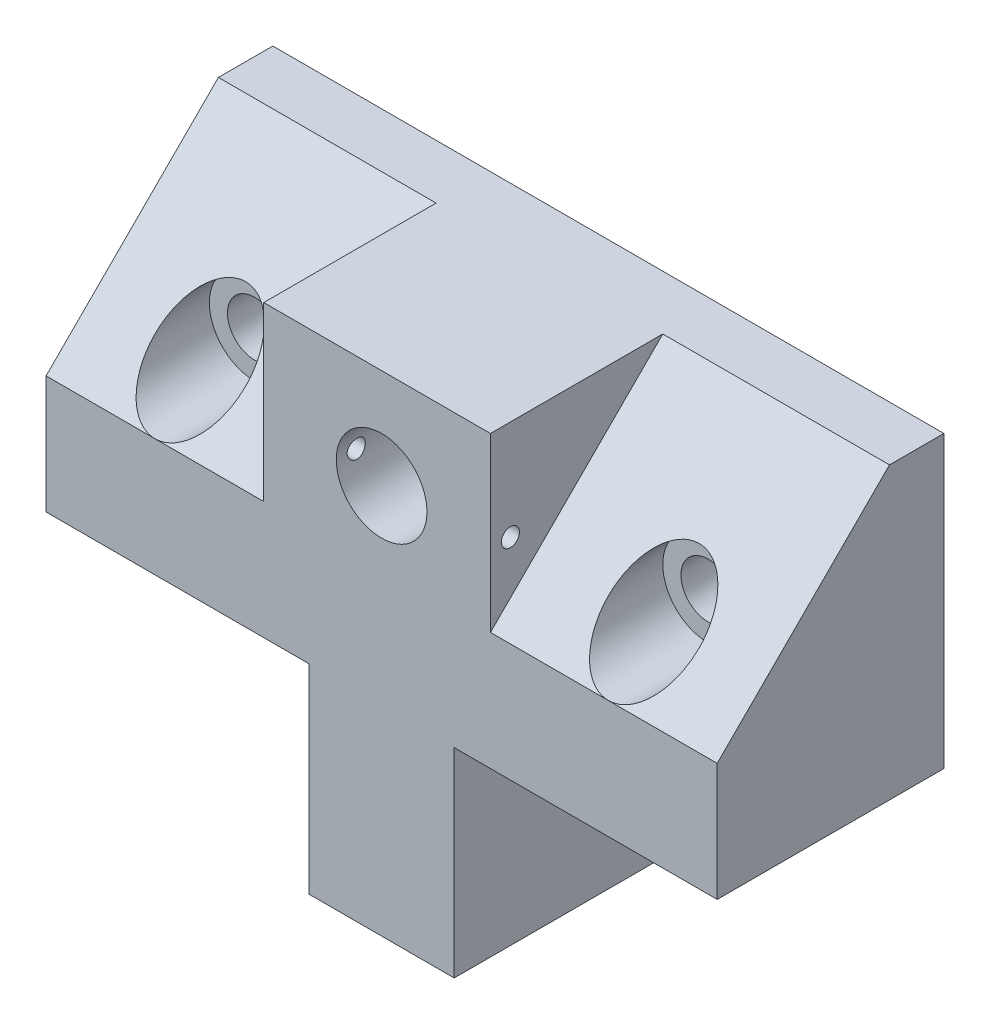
ISO-10303-21;
HEADER;
FILE_DESCRIPTION(('STEP AP214'),'2;1');
FILE_NAME('part.step','',(''),(''),'','','');
FILE_SCHEMA(('AUTOMOTIVE_DESIGN { 1 0 10303 214 1 1 1 1 }'));
ENDSEC;
DATA;
#1=APPLICATION_CONTEXT('core data for automotive mechanical design processes');
#2=APPLICATION_PROTOCOL_DEFINITION('international standard','automotive_design',2000,#1);
#3=PRODUCT_CONTEXT('',#1,'mechanical');
#4=PRODUCT('Part','Part','',(#3));
#5=PRODUCT_RELATED_PRODUCT_CATEGORY('part','',(#4));
#6=PRODUCT_DEFINITION_FORMATION('','',#4);
#7=PRODUCT_DEFINITION_CONTEXT('part definition',#1,'design');
#8=PRODUCT_DEFINITION('design','',#6,#7);
#9=PRODUCT_DEFINITION_SHAPE('','',#8);
#10=(LENGTH_UNIT() NAMED_UNIT(*) SI_UNIT(.MILLI.,.METRE.));
#11=(NAMED_UNIT(*) PLANE_ANGLE_UNIT() SI_UNIT($,.RADIAN.));
#12=(NAMED_UNIT(*) SI_UNIT($,.STERADIAN.) SOLID_ANGLE_UNIT());
#13=UNCERTAINTY_MEASURE_WITH_UNIT(LENGTH_MEASURE(1.E-05),#10,'distance_accuracy_value','');
#14=(GEOMETRIC_REPRESENTATION_CONTEXT(3) GLOBAL_UNCERTAINTY_ASSIGNED_CONTEXT((#13)) GLOBAL_UNIT_ASSIGNED_CONTEXT((#10,
#11,#12)) REPRESENTATION_CONTEXT('',''));
#15=CARTESIAN_POINT('',(0.,0.,0.));
#16=DIRECTION('',(0.,0.,1.));
#17=DIRECTION('',(1.,0.,0.));
#18=AXIS2_PLACEMENT_3D('',#15,#16,#17);
#19=CARTESIAN_POINT('',(-37.,54.,-12.5));
#20=DIRECTION('',(0.,0.,1.));
#21=DIRECTION('',(1.,0.,0.));
#22=AXIS2_PLACEMENT_3D('',#19,#20,#21);
#23=PLANE('',#22);
#24=DIRECTION('',(0.,-1.,0.));
#25=VECTOR('',#24,1.);
#26=CARTESIAN_POINT('',(-8.,22.,-12.5));
#27=LINE('',#26,#25);
#28=CARTESIAN_POINT('',(-8.,22.,-12.5));
#29=VERTEX_POINT('',#28);
#30=CARTESIAN_POINT('',(-8.,0.,-12.5));
#31=VERTEX_POINT('',#30);
#32=EDGE_CURVE('E152',#29,#31,#27,.T.);
#33=ORIENTED_EDGE('',*,*,#32,.F.);
#34=DIRECTION('',(1.,0.,0.));
#35=VECTOR('',#34,1.);
#36=CARTESIAN_POINT('',(-37.,22.,-12.5));
#37=LINE('',#36,#35);
#38=CARTESIAN_POINT('',(-37.,22.,-12.5));
#39=VERTEX_POINT('',#38);
#40=EDGE_CURVE('E177',#39,#29,#37,.T.);
#41=ORIENTED_EDGE('',*,*,#40,.F.);
#42=DIRECTION('',(0.,-1.,0.));
#43=VECTOR('',#42,1.);
#44=CARTESIAN_POINT('',(-37.,54.,-12.5));
#45=LINE('',#44,#43);
#46=CARTESIAN_POINT('',(-37.,54.,-12.5));
#47=VERTEX_POINT('',#46);
#48=EDGE_CURVE('E186',#47,#39,#45,.T.);
#49=ORIENTED_EDGE('',*,*,#48,.F.);
#50=DIRECTION('',(-1.,0.,0.));
#51=VECTOR('',#50,1.);
#52=CARTESIAN_POINT('',(-37.,54.,-12.5));
#53=LINE('',#52,#51);
#54=CARTESIAN_POINT('',(37.,54.,-12.5));
#55=VERTEX_POINT('',#54);
#56=EDGE_CURVE('E175',#55,#47,#53,.T.);
#57=ORIENTED_EDGE('',*,*,#56,.F.);
#58=DIRECTION('',(0.,-1.,0.));
#59=VECTOR('',#58,1.);
#60=CARTESIAN_POINT('',(37.,54.,-12.5));
#61=LINE('',#60,#59);
#62=CARTESIAN_POINT('',(37.,22.,-12.5));
#63=VERTEX_POINT('',#62);
#64=EDGE_CURVE('E189',#55,#63,#61,.T.);
#65=ORIENTED_EDGE('',*,*,#64,.T.);
#66=DIRECTION('',(1.,0.,0.));
#67=VECTOR('',#66,1.);
#68=CARTESIAN_POINT('',(37.,22.,-12.5));
#69=LINE('',#68,#67);
#70=CARTESIAN_POINT('',(8.,22.,-12.5));
#71=VERTEX_POINT('',#70);
#72=EDGE_CURVE('E316',#71,#63,#69,.T.);
#73=ORIENTED_EDGE('',*,*,#72,.F.);
#74=DIRECTION('',(0.,1.,0.));
#75=VECTOR('',#74,1.);
#76=CARTESIAN_POINT('',(8.,22.,-12.5));
#77=LINE('',#76,#75);
#78=CARTESIAN_POINT('',(8.,0.,-12.5));
#79=VERTEX_POINT('',#78);
#80=EDGE_CURVE('E209',#79,#71,#77,.T.);
#81=ORIENTED_EDGE('',*,*,#80,.F.);
#82=DIRECTION('',(-1.,0.,0.));
#83=VECTOR('',#82,1.);
#84=CARTESIAN_POINT('',(-37.,0.,-12.5));
#85=LINE('',#84,#83);
#86=EDGE_CURVE('E173',#79,#31,#85,.T.);
#87=ORIENTED_EDGE('',*,*,#86,.T.);
#88=EDGE_LOOP('',(#33,#41,#49,#57,#65,#73,#81,#87));
#89=FACE_BOUND('',#88,.T.);
#90=CARTESIAN_POINT('',(-25.,40.,-12.5));
#91=DIRECTION('',(0.,0.,1.));
#92=DIRECTION('',(1.,0.,0.));
#93=AXIS2_PLACEMENT_3D('',#90,#91,#92);
#94=CIRCLE('',#93,2.99999999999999);
#95=CARTESIAN_POINT('',(-22.,40.,-12.5));
#96=VERTEX_POINT('',#95);
#97=EDGE_CURVE('E348',#96,#96,#94,.F.);
#98=ORIENTED_EDGE('',*,*,#97,.F.);
#99=EDGE_LOOP('',(#98));
#100=FACE_BOUND('',#99,.T.);
#101=CARTESIAN_POINT('',(25.,40.,-12.5));
#102=DIRECTION('',(0.,0.,1.));
#103=DIRECTION('',(1.,0.,0.));
#104=AXIS2_PLACEMENT_3D('',#101,#102,#103);
#105=CIRCLE('',#104,2.99999999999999);
#106=CARTESIAN_POINT('',(28.,40.,-12.5));
#107=VERTEX_POINT('',#106);
#108=EDGE_CURVE('E357',#107,#107,#105,.F.);
#109=ORIENTED_EDGE('',*,*,#108,.F.);
#110=EDGE_LOOP('',(#109));
#111=FACE_BOUND('',#110,.T.);
#112=ADVANCED_FACE('F52',(#89,#100,#111),#23,.F.);
#113=CARTESIAN_POINT('',(37.,54.,12.5));
#114=DIRECTION('',(-1.,0.,0.));
#115=DIRECTION('',(0.,0.,1.));
#116=AXIS2_PLACEMENT_3D('',#113,#114,#115);
#117=PLANE('',#116);
#118=DIRECTION('',(0.,0.,-1.));
#119=VECTOR('',#118,1.);
#120=CARTESIAN_POINT('',(37.,54.,12.5));
#121=LINE('',#120,#119);
#122=CARTESIAN_POINT('',(37.,54.,-6.5));
#123=VERTEX_POINT('',#122);
#124=EDGE_CURVE('E172',#123,#55,#121,.T.);
#125=ORIENTED_EDGE('',*,*,#124,.F.);
#126=DIRECTION('',(0.,0.707106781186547,-0.707106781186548));
#127=VECTOR('',#126,1.);
#128=CARTESIAN_POINT('',(37.,54.,-6.5));
#129=LINE('',#128,#127);
#130=CARTESIAN_POINT('',(37.,35.,12.5));
#131=VERTEX_POINT('',#130);
#132=EDGE_CURVE('E197',#123,#131,#129,.F.);
#133=ORIENTED_EDGE('',*,*,#132,.T.);
#134=DIRECTION('',(0.,-1.,0.));
#135=VECTOR('',#134,1.);
#136=CARTESIAN_POINT('',(37.,54.,12.5));
#137=LINE('',#136,#135);
#138=CARTESIAN_POINT('',(37.,22.,12.5));
#139=VERTEX_POINT('',#138);
#140=EDGE_CURVE('E181',#131,#139,#137,.T.);
#141=ORIENTED_EDGE('',*,*,#140,.T.);
#142=DIRECTION('',(0.,0.,1.));
#143=VECTOR('',#142,1.);
#144=CARTESIAN_POINT('',(37.,22.,-48.9005494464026));
#145=LINE('',#144,#143);
#146=EDGE_CURVE('E318',#63,#139,#145,.T.);
#147=ORIENTED_EDGE('',*,*,#146,.F.);
#148=ORIENTED_EDGE('',*,*,#64,.F.);
#149=EDGE_LOOP('',(#125,#133,#141,#147,#148));
#150=FACE_BOUND('',#149,.T.);
#151=ADVANCED_FACE('F262',(#150),#117,.F.);
#152=CARTESIAN_POINT('',(-37.,54.,12.5));
#153=DIRECTION('',(1.,0.,0.));
#154=DIRECTION('',(0.,0.,-1.));
#155=AXIS2_PLACEMENT_3D('',#152,#153,#154);
#156=PLANE('',#155);
#157=DIRECTION('',(0.,-1.,0.));
#158=VECTOR('',#157,1.);
#159=CARTESIAN_POINT('',(-37.,54.,12.5));
#160=LINE('',#159,#158);
#161=CARTESIAN_POINT('',(-37.,35.,12.5));
#162=VERTEX_POINT('',#161);
#163=CARTESIAN_POINT('',(-37.,22.,12.5));
#164=VERTEX_POINT('',#163);
#165=EDGE_CURVE('E183',#162,#164,#160,.T.);
#166=ORIENTED_EDGE('',*,*,#165,.F.);
#167=DIRECTION('',(0.,-0.707106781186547,0.707106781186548));
#168=VECTOR('',#167,1.);
#169=CARTESIAN_POINT('',(-37.,54.,-6.5));
#170=LINE('',#169,#168);
#171=CARTESIAN_POINT('',(-37.,54.,-6.5));
#172=VERTEX_POINT('',#171);
#173=EDGE_CURVE('E13',#162,#172,#170,.F.);
#174=ORIENTED_EDGE('',*,*,#173,.T.);
#175=DIRECTION('',(0.,0.,1.));
#176=VECTOR('',#175,1.);
#177=CARTESIAN_POINT('',(-37.,54.,12.5));
#178=LINE('',#177,#176);
#179=EDGE_CURVE('E309',#47,#172,#178,.T.);
#180=ORIENTED_EDGE('',*,*,#179,.F.);
#181=ORIENTED_EDGE('',*,*,#48,.T.);
#182=DIRECTION('',(0.,0.,1.));
#183=VECTOR('',#182,1.);
#184=CARTESIAN_POINT('',(-37.,22.,-48.9005494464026));
#185=LINE('',#184,#183);
#186=EDGE_CURVE('E330',#39,#164,#185,.T.);
#187=ORIENTED_EDGE('',*,*,#186,.T.);
#188=EDGE_LOOP('',(#166,#174,#180,#181,#187));
#189=FACE_BOUND('',#188,.T.);
#190=ADVANCED_FACE('F270',(#189),#156,.F.);
#191=CARTESIAN_POINT('',(-37.,54.,12.5));
#192=DIRECTION('',(0.,0.,-1.));
#193=DIRECTION('',(-1.,0.,0.));
#194=AXIS2_PLACEMENT_3D('',#191,#192,#193);
#195=PLANE('',#194);
#196=CARTESIAN_POINT('',(0.,43.,12.5));
#197=DIRECTION('',(0.,0.,1.));
#198=DIRECTION('',(1.,0.,0.));
#199=AXIS2_PLACEMENT_3D('',#196,#197,#198);
#200=CIRCLE('',#199,5.);
#201=CARTESIAN_POINT('',(5.,43.,12.5));
#202=VERTEX_POINT('',#201);
#203=EDGE_CURVE('E336',#202,#202,#200,.T.);
#204=ORIENTED_EDGE('',*,*,#203,.F.);
#205=EDGE_LOOP('',(#204));
#206=FACE_BOUND('',#205,.T.);
#207=DIRECTION('',(1.,0.,0.));
#208=VECTOR('',#207,1.);
#209=CARTESIAN_POINT('',(-37.,54.,12.5));
#210=LINE('',#209,#208);
#211=CARTESIAN_POINT('',(-13.,54.,12.5));
#212=VERTEX_POINT('',#211);
#213=CARTESIAN_POINT('',(12.,54.,12.5));
#214=VERTEX_POINT('',#213);
#215=EDGE_CURVE('E184',#212,#214,#210,.T.);
#216=ORIENTED_EDGE('',*,*,#215,.F.);
#217=DIRECTION('',(0.,-1.,0.));
#218=VECTOR('',#217,1.);
#219=CARTESIAN_POINT('',(-13.,35.,12.5));
#220=LINE('',#219,#218);
#221=CARTESIAN_POINT('',(-13.,35.,12.5));
#222=VERTEX_POINT('',#221);
#223=EDGE_CURVE('E61',#212,#222,#220,.T.);
#224=ORIENTED_EDGE('',*,*,#223,.T.);
#225=DIRECTION('',(-1.,0.,0.));
#226=VECTOR('',#225,1.);
#227=CARTESIAN_POINT('',(-37.,35.,12.5));
#228=LINE('',#227,#226);
#229=CARTESIAN_POINT('',(-25.,35.,12.5));
#230=VERTEX_POINT('',#229);
#231=EDGE_CURVE('E216',#222,#230,#228,.T.);
#232=ORIENTED_EDGE('',*,*,#231,.T.);
#233=EDGE_CURVE('E215',#230,#162,#228,.T.);
#234=ORIENTED_EDGE('',*,*,#233,.T.);
#235=ORIENTED_EDGE('',*,*,#165,.T.);
#236=DIRECTION('',(-1.,0.,0.));
#237=VECTOR('',#236,1.);
#238=CARTESIAN_POINT('',(-37.,22.,12.5));
#239=LINE('',#238,#237);
#240=CARTESIAN_POINT('',(-8.,22.,12.5));
#241=VERTEX_POINT('',#240);
#242=EDGE_CURVE('E158',#241,#164,#239,.T.);
#243=ORIENTED_EDGE('',*,*,#242,.F.);
#244=DIRECTION('',(0.,1.,0.));
#245=VECTOR('',#244,1.);
#246=CARTESIAN_POINT('',(-8.,22.,12.5));
#247=LINE('',#246,#245);
#248=CARTESIAN_POINT('',(-8.,0.,12.5));
#249=VERTEX_POINT('',#248);
#250=EDGE_CURVE('E149',#249,#241,#247,.T.);
#251=ORIENTED_EDGE('',*,*,#250,.F.);
#252=DIRECTION('',(1.,0.,0.));
#253=VECTOR('',#252,1.);
#254=CARTESIAN_POINT('',(-37.,0.,12.5));
#255=LINE('',#254,#253);
#256=CARTESIAN_POINT('',(8.,0.,12.5));
#257=VERTEX_POINT('',#256);
#258=EDGE_CURVE('E165',#249,#257,#255,.T.);
#259=ORIENTED_EDGE('',*,*,#258,.T.);
#260=DIRECTION('',(0.,-1.,0.));
#261=VECTOR('',#260,1.);
#262=CARTESIAN_POINT('',(8.,22.,12.5));
#263=LINE('',#262,#261);
#264=CARTESIAN_POINT('',(8.,22.,12.5));
#265=VERTEX_POINT('',#264);
#266=EDGE_CURVE('E321',#265,#257,#263,.T.);
#267=ORIENTED_EDGE('',*,*,#266,.F.);
#268=DIRECTION('',(-1.,0.,0.));
#269=VECTOR('',#268,1.);
#270=CARTESIAN_POINT('',(37.,22.,12.5));
#271=LINE('',#270,#269);
#272=EDGE_CURVE('E167',#139,#265,#271,.T.);
#273=ORIENTED_EDGE('',*,*,#272,.F.);
#274=ORIENTED_EDGE('',*,*,#140,.F.);
#275=DIRECTION('',(-1.,0.,0.));
#276=VECTOR('',#275,1.);
#277=CARTESIAN_POINT('',(-37.,35.,12.5));
#278=LINE('',#277,#276);
#279=CARTESIAN_POINT('',(25.,35.,12.5));
#280=VERTEX_POINT('',#279);
#281=EDGE_CURVE('E203',#131,#280,#278,.T.);
#282=ORIENTED_EDGE('',*,*,#281,.T.);
#283=CARTESIAN_POINT('',(12.,35.,12.5));
#284=VERTEX_POINT('',#283);
#285=EDGE_CURVE('E202',#280,#284,#278,.T.);
#286=ORIENTED_EDGE('',*,*,#285,.T.);
#287=DIRECTION('',(0.,1.,0.));
#288=VECTOR('',#287,1.);
#289=CARTESIAN_POINT('',(12.,35.,12.5));
#290=LINE('',#289,#288);
#291=EDGE_CURVE('E199',#284,#214,#290,.T.);
#292=ORIENTED_EDGE('',*,*,#291,.T.);
#293=EDGE_LOOP('',(#216,#224,#232,#234,#235,#243,#251,#259,#267,#273,#274,#282,#286,#292));
#294=FACE_BOUND('',#293,.T.);
#295=ADVANCED_FACE('F163',(#206,#294),#195,.F.);
#296=CARTESIAN_POINT('',(0.,54.,0.));
#297=DIRECTION('',(0.,-1.,0.));
#298=DIRECTION('',(0.,0.,-1.));
#299=AXIS2_PLACEMENT_3D('',#296,#297,#298);
#300=PLANE('',#299);
#301=ORIENTED_EDGE('',*,*,#179,.T.);
#302=DIRECTION('',(1.,0.,0.));
#303=VECTOR('',#302,1.);
#304=CARTESIAN_POINT('',(0.,54.,-6.5));
#305=LINE('',#304,#303);
#306=CARTESIAN_POINT('',(-13.,54.,-6.5));
#307=VERTEX_POINT('',#306);
#308=EDGE_CURVE('E212',#172,#307,#305,.T.);
#309=ORIENTED_EDGE('',*,*,#308,.T.);
#310=DIRECTION('',(0.,0.,1.));
#311=VECTOR('',#310,1.);
#312=CARTESIAN_POINT('',(-13.,54.,-6.5));
#313=LINE('',#312,#311);
#314=EDGE_CURVE('E206',#307,#212,#313,.T.);
#315=ORIENTED_EDGE('',*,*,#314,.T.);
#316=ORIENTED_EDGE('',*,*,#215,.T.);
#317=DIRECTION('',(0.,0.,-1.));
#318=VECTOR('',#317,1.);
#319=CARTESIAN_POINT('',(12.,54.,-6.5));
#320=LINE('',#319,#318);
#321=CARTESIAN_POINT('',(12.,54.,-6.5));
#322=VERTEX_POINT('',#321);
#323=EDGE_CURVE('E194',#214,#322,#320,.T.);
#324=ORIENTED_EDGE('',*,*,#323,.T.);
#325=DIRECTION('',(1.,0.,0.));
#326=VECTOR('',#325,1.);
#327=CARTESIAN_POINT('',(0.,54.,-6.5));
#328=LINE('',#327,#326);
#329=EDGE_CURVE('E192',#322,#123,#328,.T.);
#330=ORIENTED_EDGE('',*,*,#329,.T.);
#331=ORIENTED_EDGE('',*,*,#124,.T.);
#332=ORIENTED_EDGE('',*,*,#56,.T.);
#333=EDGE_LOOP('',(#301,#309,#315,#316,#324,#330,#331,#332));
#334=FACE_BOUND('',#333,.T.);
#335=ADVANCED_FACE('F307',(#334),#300,.F.);
#336=CARTESIAN_POINT('',(0.,0.,0.));
#337=DIRECTION('',(0.,-1.,0.));
#338=DIRECTION('',(0.,0.,-1.));
#339=AXIS2_PLACEMENT_3D('',#336,#337,#338);
#340=PLANE('',#339);
#341=DIRECTION('',(0.,0.,1.));
#342=VECTOR('',#341,1.);
#343=CARTESIAN_POINT('',(-8.,0.,-48.9005494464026));
#344=LINE('',#343,#342);
#345=EDGE_CURVE('E145',#31,#249,#344,.T.);
#346=ORIENTED_EDGE('',*,*,#345,.F.);
#347=ORIENTED_EDGE('',*,*,#86,.F.);
#348=DIRECTION('',(0.,0.,1.));
#349=VECTOR('',#348,1.);
#350=CARTESIAN_POINT('',(8.,0.,-48.9005494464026));
#351=LINE('',#350,#349);
#352=EDGE_CURVE('E171',#79,#257,#351,.T.);
#353=ORIENTED_EDGE('',*,*,#352,.T.);
#354=ORIENTED_EDGE('',*,*,#258,.F.);
#355=EDGE_LOOP('',(#346,#347,#353,#354));
#356=FACE_BOUND('',#355,.T.);
#357=ADVANCED_FACE('F170',(#356),#340,.T.);
#358=CARTESIAN_POINT('',(37.,22.,-48.9005494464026));
#359=DIRECTION('',(0.,1.,0.));
#360=DIRECTION('',(0.,0.,1.));
#361=AXIS2_PLACEMENT_3D('',#358,#359,#360);
#362=PLANE('',#361);
#363=ORIENTED_EDGE('',*,*,#72,.T.);
#364=ORIENTED_EDGE('',*,*,#146,.T.);
#365=ORIENTED_EDGE('',*,*,#272,.T.);
#366=DIRECTION('',(0.,0.,1.));
#367=VECTOR('',#366,1.);
#368=CARTESIAN_POINT('',(8.,22.,-48.9005494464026));
#369=LINE('',#368,#367);
#370=EDGE_CURVE('E323',#71,#265,#369,.T.);
#371=ORIENTED_EDGE('',*,*,#370,.F.);
#372=EDGE_LOOP('',(#363,#364,#365,#371));
#373=FACE_BOUND('',#372,.T.);
#374=ADVANCED_FACE('F470',(#373),#362,.F.);
#375=CARTESIAN_POINT('',(8.,22.,-48.9005494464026));
#376=DIRECTION('',(-1.,0.,0.));
#377=DIRECTION('',(0.,-1.,0.));
#378=AXIS2_PLACEMENT_3D('',#375,#376,#377);
#379=PLANE('',#378);
#380=ORIENTED_EDGE('',*,*,#80,.T.);
#381=ORIENTED_EDGE('',*,*,#370,.T.);
#382=ORIENTED_EDGE('',*,*,#266,.T.);
#383=ORIENTED_EDGE('',*,*,#352,.F.);
#384=EDGE_LOOP('',(#380,#381,#382,#383));
#385=FACE_BOUND('',#384,.T.);
#386=ADVANCED_FACE('F479',(#385),#379,.F.);
#387=CARTESIAN_POINT('',(-37.,22.,-48.9005494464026));
#388=DIRECTION('',(0.,1.,0.));
#389=DIRECTION('',(0.,0.,1.));
#390=AXIS2_PLACEMENT_3D('',#387,#388,#389);
#391=PLANE('',#390);
#392=ORIENTED_EDGE('',*,*,#40,.T.);
#393=DIRECTION('',(0.,0.,1.));
#394=VECTOR('',#393,1.);
#395=CARTESIAN_POINT('',(-8.,22.,-48.9005494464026));
#396=LINE('',#395,#394);
#397=EDGE_CURVE('E157',#29,#241,#396,.T.);
#398=ORIENTED_EDGE('',*,*,#397,.T.);
#399=ORIENTED_EDGE('',*,*,#242,.T.);
#400=ORIENTED_EDGE('',*,*,#186,.F.);
#401=EDGE_LOOP('',(#392,#398,#399,#400));
#402=FACE_BOUND('',#401,.T.);
#403=ADVANCED_FACE('F489',(#402),#391,.F.);
#404=CARTESIAN_POINT('',(-8.,22.,-48.9005494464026));
#405=DIRECTION('',(1.,0.,0.));
#406=DIRECTION('',(0.,1.,0.));
#407=AXIS2_PLACEMENT_3D('',#404,#405,#406);
#408=PLANE('',#407);
#409=ORIENTED_EDGE('',*,*,#32,.T.);
#410=ORIENTED_EDGE('',*,*,#345,.T.);
#411=ORIENTED_EDGE('',*,*,#250,.T.);
#412=ORIENTED_EDGE('',*,*,#397,.F.);
#413=EDGE_LOOP('',(#409,#410,#411,#412));
#414=FACE_BOUND('',#413,.T.);
#415=ADVANCED_FACE('F147',(#414),#408,.F.);
#416=CARTESIAN_POINT('',(0.,54.,-6.5));
#417=DIRECTION('',(0.,-0.707106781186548,-0.707106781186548));
#418=DIRECTION('',(1.,0.,0.));
#419=AXIS2_PLACEMENT_3D('',#416,#417,#418);
#420=PLANE('',#419);
#421=ORIENTED_EDGE('',*,*,#285,.F.);
#422=CARTESIAN_POINT('',(25.,40.,7.5));
#423=DIRECTION('',(0.,-0.707106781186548,-0.707106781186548));
#424=DIRECTION('',(0.,-0.707106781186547,0.707106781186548));
#425=AXIS2_PLACEMENT_3D('',#422,#423,#424);
#426=ELLIPSE('',#425,7.07106781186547,5.);
#427=EDGE_CURVE('E56',#280,#280,#426,.F.);
#428=ORIENTED_EDGE('',*,*,#427,.F.);
#429=ORIENTED_EDGE('',*,*,#281,.F.);
#430=ORIENTED_EDGE('',*,*,#132,.F.);
#431=ORIENTED_EDGE('',*,*,#329,.F.);
#432=DIRECTION('',(0.,0.707106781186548,-0.707106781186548));
#433=VECTOR('',#432,1.);
#434=CARTESIAN_POINT('',(12.,35.,12.5));
#435=LINE('',#434,#433);
#436=EDGE_CURVE('E207',#284,#322,#435,.T.);
#437=ORIENTED_EDGE('',*,*,#436,.F.);
#438=EDGE_LOOP('',(#421,#428,#429,#430,#431,#437));
#439=FACE_BOUND('',#438,.T.);
#440=ADVANCED_FACE('F279',(#439),#420,.F.);
#441=CARTESIAN_POINT('',(12.,35.,-6.5));
#442=DIRECTION('',(1.,0.,0.));
#443=DIRECTION('',(0.,0.,-1.));
#444=AXIS2_PLACEMENT_3D('',#441,#442,#443);
#445=PLANE('',#444);
#446=CARTESIAN_POINT('',(12.,43.,10.3055306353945));
#447=DIRECTION('',(1.,0.,0.));
#448=DIRECTION('',(0.,0.,-1.));
#449=AXIS2_PLACEMENT_3D('',#446,#447,#448);
#450=CIRCLE('',#449,1.);
#451=CARTESIAN_POINT('',(12.,43.,9.30553063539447));
#452=VERTEX_POINT('',#451);
#453=EDGE_CURVE('E342',#452,#452,#450,.T.);
#454=ORIENTED_EDGE('',*,*,#453,.F.);
#455=EDGE_LOOP('',(#454));
#456=FACE_BOUND('',#455,.T.);
#457=ORIENTED_EDGE('',*,*,#323,.F.);
#458=ORIENTED_EDGE('',*,*,#291,.F.);
#459=ORIENTED_EDGE('',*,*,#436,.T.);
#460=EDGE_LOOP('',(#457,#458,#459));
#461=FACE_BOUND('',#460,.T.);
#462=ADVANCED_FACE('F277',(#456,#461),#445,.T.);
#463=CARTESIAN_POINT('',(-13.,35.,-6.5));
#464=DIRECTION('',(-1.,0.,0.));
#465=DIRECTION('',(0.,0.,1.));
#466=AXIS2_PLACEMENT_3D('',#463,#464,#465);
#467=PLANE('',#466);
#468=CARTESIAN_POINT('',(-13.,43.,10.3055306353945));
#469=DIRECTION('',(-1.,0.,0.));
#470=DIRECTION('',(0.,0.,1.));
#471=AXIS2_PLACEMENT_3D('',#468,#469,#470);
#472=CIRCLE('',#471,1.);
#473=CARTESIAN_POINT('',(-13.,43.,11.3055306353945));
#474=VERTEX_POINT('',#473);
#475=EDGE_CURVE('E231',#474,#474,#472,.F.);
#476=ORIENTED_EDGE('',*,*,#475,.T.);
#477=EDGE_LOOP('',(#476));
#478=FACE_BOUND('',#477,.T.);
#479=ORIENTED_EDGE('',*,*,#223,.F.);
#480=ORIENTED_EDGE('',*,*,#314,.F.);
#481=DIRECTION('',(0.,-0.707106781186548,0.707106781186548));
#482=VECTOR('',#481,1.);
#483=CARTESIAN_POINT('',(-13.,54.,-6.5));
#484=LINE('',#483,#482);
#485=EDGE_CURVE('E210',#222,#307,#484,.F.);
#486=ORIENTED_EDGE('',*,*,#485,.F.);
#487=EDGE_LOOP('',(#479,#480,#486));
#488=FACE_BOUND('',#487,.T.);
#489=ADVANCED_FACE('F54',(#478,#488),#467,.T.);
#490=CARTESIAN_POINT('',(0.,54.,-6.5));
#491=DIRECTION('',(0.,-0.707106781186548,-0.707106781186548));
#492=DIRECTION('',(1.,0.,0.));
#493=AXIS2_PLACEMENT_3D('',#490,#491,#492);
#494=PLANE('',#493);
#495=ORIENTED_EDGE('',*,*,#233,.F.);
#496=CARTESIAN_POINT('',(-25.,40.,7.5));
#497=DIRECTION('',(0.,-0.707106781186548,-0.707106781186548));
#498=DIRECTION('',(0.,-0.707106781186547,0.707106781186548));
#499=AXIS2_PLACEMENT_3D('',#496,#497,#498);
#500=ELLIPSE('',#499,7.07106781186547,5.);
#501=EDGE_CURVE('E71',#230,#230,#500,.F.);
#502=ORIENTED_EDGE('',*,*,#501,.F.);
#503=ORIENTED_EDGE('',*,*,#231,.F.);
#504=ORIENTED_EDGE('',*,*,#485,.T.);
#505=ORIENTED_EDGE('',*,*,#308,.F.);
#506=ORIENTED_EDGE('',*,*,#173,.F.);
#507=EDGE_LOOP('',(#495,#502,#503,#504,#505,#506));
#508=FACE_BOUND('',#507,.T.);
#509=ADVANCED_FACE('F258',(#508),#494,.F.);
#510=CARTESIAN_POINT('',(0.,43.,-0.5));
#511=DIRECTION('',(0.,0.,1.));
#512=DIRECTION('',(1.,0.,0.));
#513=AXIS2_PLACEMENT_3D('',#510,#511,#512);
#514=CYLINDRICAL_SURFACE('',#513,5.);
#515=CARTESIAN_POINT('',(5.,43.,9.30553063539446));
#516=CARTESIAN_POINT('',(4.99999897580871,43.0555769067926,9.30553267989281));
#517=CARTESIAN_POINT('',(4.99906385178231,43.1111796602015,9.31017947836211));
#518=CARTESIAN_POINT('',(4.99542365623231,43.220813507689,9.32862913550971));
#519=CARTESIAN_POINT('',(4.99271717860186,43.2748433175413,9.34243926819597));
#520=CARTESIAN_POINT('',(4.98583649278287,43.3797303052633,9.37877190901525));
#521=CARTESIAN_POINT('',(4.98166369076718,43.4305904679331,9.40128607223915));
#522=CARTESIAN_POINT('',(4.97230398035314,43.5278079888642,9.45436288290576));
#523=CARTESIAN_POINT('',(4.96711713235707,43.5741656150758,9.48492505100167));
#524=CARTESIAN_POINT('',(4.9562216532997,43.6616934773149,9.5536691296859));
#525=CARTESIAN_POINT('',(4.95050745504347,43.7027939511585,9.59193899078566));
#526=CARTESIAN_POINT('',(4.93924180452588,43.778036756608,9.67482305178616));
#527=CARTESIAN_POINT('',(4.93369036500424,43.8121785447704,9.71943774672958));
#528=CARTESIAN_POINT('',(4.92332441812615,43.8728317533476,9.81424682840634));
#529=CARTESIAN_POINT('',(4.91851707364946,43.8992709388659,9.86448827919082));
#530=CARTESIAN_POINT('',(4.91026268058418,43.9433056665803,9.96881245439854));
#531=CARTESIAN_POINT('',(4.90681549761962,43.9609020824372,10.0228947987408));
#532=CARTESIAN_POINT('',(4.90172805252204,43.9865252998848,10.1326149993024));
#533=CARTESIAN_POINT('',(4.90006470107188,43.9946744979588,10.1882231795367));
#534=CARTESIAN_POINT('',(4.89866375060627,44.0015521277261,10.3000404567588));
#535=CARTESIAN_POINT('',(4.89892595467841,44.0002815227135,10.3562494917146));
#536=CARTESIAN_POINT('',(4.90132551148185,43.9884545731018,10.4667774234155));
#537=CARTESIAN_POINT('',(4.90343452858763,43.9780385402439,10.5211120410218));
#538=CARTESIAN_POINT('',(4.90924546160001,43.948437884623,10.6272467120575));
#539=CARTESIAN_POINT('',(4.91294745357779,43.9292528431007,10.6790466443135));
#540=CARTESIAN_POINT('',(4.92155618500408,43.8825247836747,10.7790458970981));
#541=CARTESIAN_POINT('',(4.92647089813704,43.8549261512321,10.8272185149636));
#542=CARTESIAN_POINT('',(4.93694618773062,43.7921935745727,10.9183014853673));
#543=CARTESIAN_POINT('',(4.94250683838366,43.7570587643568,10.9612112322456));
#544=CARTESIAN_POINT('',(4.95377021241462,43.6794999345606,11.0413600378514));
#545=CARTESIAN_POINT('',(4.95947369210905,43.6369561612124,11.0784832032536));
#546=CARTESIAN_POINT('',(4.97028848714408,43.546185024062,11.1450844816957));
#547=CARTESIAN_POINT('',(4.97539979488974,43.4979575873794,11.174562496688));
#548=CARTESIAN_POINT('',(4.98446690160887,43.3970593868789,11.2250581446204));
#549=CARTESIAN_POINT('',(4.98842088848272,43.3443818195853,11.246062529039));
#550=CARTESIAN_POINT('',(4.99471408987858,43.2361489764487,11.278891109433));
#551=CARTESIAN_POINT('',(4.99705350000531,43.1805940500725,11.2907164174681));
#552=CARTESIAN_POINT('',(4.99982671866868,43.0691794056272,11.3046870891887));
#553=CARTESIAN_POINT('',(5.0002917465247,43.0133403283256,11.3069910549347));
#554=CARTESIAN_POINT('',(4.99935051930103,42.9020750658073,11.3022807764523));
#555=CARTESIAN_POINT('',(4.99794436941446,42.8466488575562,11.2952670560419));
#556=CARTESIAN_POINT('',(4.99343832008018,42.7382943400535,11.2722522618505));
#557=CARTESIAN_POINT('',(4.99035376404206,42.6853480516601,11.2563325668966));
#558=CARTESIAN_POINT('',(4.98283552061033,42.5828763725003,11.2160466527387));
#559=CARTESIAN_POINT('',(4.97840173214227,42.5333512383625,11.1916798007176));
#560=CARTESIAN_POINT('',(4.96859911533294,42.4384588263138,11.1348481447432));
#561=CARTESIAN_POINT('',(4.96321950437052,42.3931498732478,11.1022878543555));
#562=CARTESIAN_POINT('',(4.95214734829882,42.3085819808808,11.0301214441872));
#563=CARTESIAN_POINT('',(4.94645476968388,42.2693236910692,10.9905145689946));
#564=CARTESIAN_POINT('',(4.93529303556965,42.1973594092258,10.9046572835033));
#565=CARTESIAN_POINT('',(4.92982860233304,42.1647622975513,10.8583148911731));
#566=CARTESIAN_POINT('',(4.91984191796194,42.1078145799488,10.7607192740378));
#567=CARTESIAN_POINT('',(4.91531962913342,42.0834636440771,10.7094662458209));
#568=CARTESIAN_POINT('',(4.90776740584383,42.043848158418,10.6037623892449));
#569=CARTESIAN_POINT('',(4.90472974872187,42.028536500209,10.5493297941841));
#570=CARTESIAN_POINT('',(4.90047436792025,42.0072913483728,10.4385971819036));
#571=CARTESIAN_POINT('',(4.89925640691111,42.0013566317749,10.3822974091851));
#572=CARTESIAN_POINT('',(4.89879149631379,41.9990790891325,10.2705217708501));
#573=CARTESIAN_POINT('',(4.89950919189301,42.0025642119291,10.2150494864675));
#574=CARTESIAN_POINT('',(4.90275573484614,42.0186476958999,10.1054989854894));
#575=CARTESIAN_POINT('',(4.90528456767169,42.0312459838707,10.0514207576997));
#576=CARTESIAN_POINT('',(4.91185264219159,42.065121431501,9.94630292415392));
#577=CARTESIAN_POINT('',(4.9158882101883,42.0863774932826,9.89525627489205));
#578=CARTESIAN_POINT('',(4.9250171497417,42.1369453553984,9.79742691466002));
#579=CARTESIAN_POINT('',(4.93011060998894,42.1662578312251,9.75064456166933));
#580=CARTESIAN_POINT('',(4.94088960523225,42.2326940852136,9.66181506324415));
#581=CARTESIAN_POINT('',(4.946583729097,42.2699421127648,9.61986187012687));
#582=CARTESIAN_POINT('',(4.95786081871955,42.3509356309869,9.54274442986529));
#583=CARTESIAN_POINT('',(4.96344375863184,42.3946826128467,9.50758174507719));
#584=CARTESIAN_POINT('',(4.97393832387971,42.4879823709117,9.44469599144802));
#585=CARTESIAN_POINT('',(4.97884231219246,42.5375911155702,9.41705463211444));
#586=CARTESIAN_POINT('',(4.98735125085,42.6408336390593,9.37054451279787));
#587=CARTESIAN_POINT('',(4.99095737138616,42.6944637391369,9.35166784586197));
#588=CARTESIAN_POINT('',(4.99576372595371,42.7901785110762,9.32687868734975));
#589=CARTESIAN_POINT('',(4.99734303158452,42.8317183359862,9.31888744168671));
#590=CARTESIAN_POINT('',(4.99946154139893,42.9155004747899,9.3082127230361));
#591=CARTESIAN_POINT('',(5.00000077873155,42.9577427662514,9.30552908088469));
#592=CARTESIAN_POINT('',(5.,43.,9.30553063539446));
#593=B_SPLINE_CURVE_WITH_KNOTS('',3,(#515,#516,#517,#518,#519,#520,#521,#522,#523,#524,#525,
#526,#527,#528,#529,#530,#531,#532,#533,#534,#535,#536,#537,#538,#539,#540,#541,#542,#543,#544,
#545,#546,#547,#548,#549,#550,#551,#552,#553,#554,#555,#556,#557,#558,#559,#560,#561,#562,#563,
#564,#565,#566,#567,#568,#569,#570,#571,#572,#573,#574,#575,#576,#577,#578,#579,#580,#581,#582,
#583,#584,#585,#586,#587,#588,#589,#590,#591,#592),.UNSPECIFIED.,.T.,.F.,(4,2,2,2,2,2,2,2,2,2,2,
2,2,2,2,2,2,2,2,2,2,2,2,2,2,2,2,2,2,2,2,2,2,2,2,2,2,2,4),(0.,0.166576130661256,
0.333284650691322,0.499833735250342,0.66637290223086,0.83493267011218,1.00350559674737,
1.17361195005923,1.34370149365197,1.51156185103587,1.67940504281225,1.84471727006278,
2.0100373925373,2.17647490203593,2.3429315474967,2.51238252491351,2.6818356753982,
2.85155274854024,3.02124925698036,3.18810735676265,3.35495607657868,3.52030453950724,
3.68566539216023,3.85305066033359,4.02045388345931,4.19040628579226,4.36035188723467,
4.52940381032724,4.69843368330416,4.86439722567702,5.03035943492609,5.19591961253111,
5.36149367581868,5.52988076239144,5.69830654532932,5.86849496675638,6.0385295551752,
6.16518775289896,6.29184191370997),.UNSPECIFIED.);
#594=CARTESIAN_POINT('',(5.,43.,9.30553063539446));
#595=VERTEX_POINT('',#594);
#596=EDGE_CURVE('E230',#595,#595,#593,.T.);
#597=ORIENTED_EDGE('',*,*,#596,.T.);
#598=EDGE_LOOP('',(#597));
#599=FACE_BOUND('',#598,.T.);
#600=CARTESIAN_POINT('',(-5.,43.,9.30553063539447));
#601=CARTESIAN_POINT('',(-4.99999897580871,42.9444230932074,9.30553267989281));
#602=CARTESIAN_POINT('',(-4.99906385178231,42.8888203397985,9.31017947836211));
#603=CARTESIAN_POINT('',(-4.99542365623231,42.779186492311,9.32862913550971));
#604=CARTESIAN_POINT('',(-4.99271717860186,42.7251566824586,9.34243926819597));
#605=CARTESIAN_POINT('',(-4.98583649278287,42.6202696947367,9.37877190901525));
#606=CARTESIAN_POINT('',(-4.98166369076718,42.5694095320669,9.40128607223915));
#607=CARTESIAN_POINT('',(-4.97230398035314,42.4721920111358,9.45436288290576));
#608=CARTESIAN_POINT('',(-4.96711713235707,42.4258343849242,9.48492505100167));
#609=CARTESIAN_POINT('',(-4.9562216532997,42.3383065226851,9.5536691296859));
#610=CARTESIAN_POINT('',(-4.95050745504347,42.2972060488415,9.59193899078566));
#611=CARTESIAN_POINT('',(-4.93924180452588,42.221963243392,9.67482305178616));
#612=CARTESIAN_POINT('',(-4.93369036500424,42.1878214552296,9.71943774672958));
#613=CARTESIAN_POINT('',(-4.92332441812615,42.1271682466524,9.81424682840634));
#614=CARTESIAN_POINT('',(-4.91851707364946,42.1007290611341,9.86448827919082));
#615=CARTESIAN_POINT('',(-4.91026268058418,42.0566943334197,9.96881245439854));
#616=CARTESIAN_POINT('',(-4.90681549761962,42.0390979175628,10.0228947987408));
#617=CARTESIAN_POINT('',(-4.90172805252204,42.0134747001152,10.1326149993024));
#618=CARTESIAN_POINT('',(-4.90006470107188,42.0053255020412,10.1882231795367));
#619=CARTESIAN_POINT('',(-4.89866375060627,41.9984478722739,10.3000404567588));
#620=CARTESIAN_POINT('',(-4.89892595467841,41.9997184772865,10.3562494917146));
#621=CARTESIAN_POINT('',(-4.90132551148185,42.0115454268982,10.4667774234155));
#622=CARTESIAN_POINT('',(-4.90343452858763,42.0219614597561,10.5211120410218));
#623=CARTESIAN_POINT('',(-4.90924546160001,42.0515621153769,10.6272467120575));
#624=CARTESIAN_POINT('',(-4.91294745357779,42.0707471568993,10.6790466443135));
#625=CARTESIAN_POINT('',(-4.92155618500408,42.1174752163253,10.7790458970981));
#626=CARTESIAN_POINT('',(-4.92647089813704,42.1450738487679,10.8272185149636));
#627=CARTESIAN_POINT('',(-4.93694618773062,42.2078064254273,10.9183014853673));
#628=CARTESIAN_POINT('',(-4.94250683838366,42.2429412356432,10.9612112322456));
#629=CARTESIAN_POINT('',(-4.95377021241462,42.3205000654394,11.0413600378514));
#630=CARTESIAN_POINT('',(-4.95947369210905,42.3630438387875,11.0784832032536));
#631=CARTESIAN_POINT('',(-4.97028848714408,42.453814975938,11.1450844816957));
#632=CARTESIAN_POINT('',(-4.97539979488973,42.5020424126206,11.174562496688));
#633=CARTESIAN_POINT('',(-4.98446690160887,42.6029406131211,11.2250581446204));
#634=CARTESIAN_POINT('',(-4.98842088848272,42.6556181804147,11.246062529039));
#635=CARTESIAN_POINT('',(-4.99471408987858,42.7638510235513,11.278891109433));
#636=CARTESIAN_POINT('',(-4.99705350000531,42.8194059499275,11.2907164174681));
#637=CARTESIAN_POINT('',(-4.99982671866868,42.9308205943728,11.3046870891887));
#638=CARTESIAN_POINT('',(-5.0002917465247,42.9866596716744,11.3069910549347));
#639=CARTESIAN_POINT('',(-4.99935051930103,43.0979249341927,11.3022807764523));
#640=CARTESIAN_POINT('',(-4.99794436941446,43.1533511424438,11.2952670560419));
#641=CARTESIAN_POINT('',(-4.99343832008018,43.2617056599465,11.2722522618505));
#642=CARTESIAN_POINT('',(-4.99035376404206,43.3146519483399,11.2563325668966));
#643=CARTESIAN_POINT('',(-4.98283552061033,43.4171236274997,11.2160466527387));
#644=CARTESIAN_POINT('',(-4.97840173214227,43.4666487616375,11.1916798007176));
#645=CARTESIAN_POINT('',(-4.96859911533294,43.5615411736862,11.1348481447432));
#646=CARTESIAN_POINT('',(-4.96321950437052,43.6068501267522,11.1022878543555));
#647=CARTESIAN_POINT('',(-4.95214734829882,43.6914180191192,11.0301214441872));
#648=CARTESIAN_POINT('',(-4.94645476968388,43.7306763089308,10.9905145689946));
#649=CARTESIAN_POINT('',(-4.93529303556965,43.8026405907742,10.9046572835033));
#650=CARTESIAN_POINT('',(-4.92982860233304,43.8352377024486,10.8583148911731));
#651=CARTESIAN_POINT('',(-4.91984191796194,43.8921854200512,10.7607192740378));
#652=CARTESIAN_POINT('',(-4.91531962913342,43.9165363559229,10.7094662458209));
#653=CARTESIAN_POINT('',(-4.90776740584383,43.956151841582,10.6037623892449));
#654=CARTESIAN_POINT('',(-4.90472974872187,43.971463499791,10.5493297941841));
#655=CARTESIAN_POINT('',(-4.90047436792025,43.9927086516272,10.4385971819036));
#656=CARTESIAN_POINT('',(-4.89925640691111,43.9986433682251,10.3822974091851));
#657=CARTESIAN_POINT('',(-4.89879149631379,44.0009209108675,10.2705217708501));
#658=CARTESIAN_POINT('',(-4.89950919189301,43.9974357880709,10.2150494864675));
#659=CARTESIAN_POINT('',(-4.90275573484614,43.9813523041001,10.1054989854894));
#660=CARTESIAN_POINT('',(-4.90528456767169,43.9687540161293,10.0514207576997));
#661=CARTESIAN_POINT('',(-4.91185264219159,43.934878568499,9.94630292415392));
#662=CARTESIAN_POINT('',(-4.9158882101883,43.9136225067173,9.89525627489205));
#663=CARTESIAN_POINT('',(-4.9250171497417,43.8630546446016,9.79742691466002));
#664=CARTESIAN_POINT('',(-4.93011060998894,43.8337421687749,9.75064456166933));
#665=CARTESIAN_POINT('',(-4.94088960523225,43.7673059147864,9.66181506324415));
#666=CARTESIAN_POINT('',(-4.946583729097,43.7300578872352,9.61986187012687));
#667=CARTESIAN_POINT('',(-4.95786081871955,43.6490643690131,9.54274442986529));
#668=CARTESIAN_POINT('',(-4.96344375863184,43.6053173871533,9.50758174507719));
#669=CARTESIAN_POINT('',(-4.97393832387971,43.5120176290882,9.44469599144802));
#670=CARTESIAN_POINT('',(-4.97884231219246,43.4624088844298,9.41705463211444));
#671=CARTESIAN_POINT('',(-4.98735125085,43.3591663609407,9.37054451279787));
#672=CARTESIAN_POINT('',(-4.99095737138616,43.3055362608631,9.35166784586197));
#673=CARTESIAN_POINT('',(-4.99576372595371,43.2098214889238,9.32687868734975));
#674=CARTESIAN_POINT('',(-4.99734303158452,43.1682816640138,9.31888744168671));
#675=CARTESIAN_POINT('',(-4.99946154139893,43.0844995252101,9.3082127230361));
#676=CARTESIAN_POINT('',(-5.00000077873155,43.0422572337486,9.3055290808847));
#677=CARTESIAN_POINT('',(-5.,43.,9.30553063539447));
#678=B_SPLINE_CURVE_WITH_KNOTS('',3,(#600,#601,#602,#603,#604,#605,#606,#607,#608,#609,#610,
#611,#612,#613,#614,#615,#616,#617,#618,#619,#620,#621,#622,#623,#624,#625,#626,#627,#628,#629,
#630,#631,#632,#633,#634,#635,#636,#637,#638,#639,#640,#641,#642,#643,#644,#645,#646,#647,#648,
#649,#650,#651,#652,#653,#654,#655,#656,#657,#658,#659,#660,#661,#662,#663,#664,#665,#666,#667,
#668,#669,#670,#671,#672,#673,#674,#675,#676,#677),.UNSPECIFIED.,.T.,.F.,(4,2,2,2,2,2,2,2,2,2,2,
2,2,2,2,2,2,2,2,2,2,2,2,2,2,2,2,2,2,2,2,2,2,2,2,2,2,2,4),(0.,0.166576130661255,
0.333284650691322,0.499833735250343,0.666372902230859,0.834932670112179,1.00350559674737,
1.17361195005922,1.34370149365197,1.51156185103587,1.67940504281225,1.84471727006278,
2.0100373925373,2.17647490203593,2.3429315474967,2.51238252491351,2.68183567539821,
2.85155274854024,3.02124925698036,3.18810735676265,3.35495607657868,3.52030453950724,
3.68566539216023,3.85305066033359,4.02045388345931,4.19040628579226,4.36035188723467,
4.52940381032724,4.69843368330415,4.86439722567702,5.03035943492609,5.19591961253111,
5.36149367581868,5.52988076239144,5.69830654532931,5.86849496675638,6.0385295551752,
6.16518775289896,6.29184191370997),.UNSPECIFIED.);
#679=CARTESIAN_POINT('',(-5.,43.,9.30553063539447));
#680=VERTEX_POINT('',#679);
#681=EDGE_CURVE('E222',#680,#680,#678,.T.);
#682=ORIENTED_EDGE('',*,*,#681,.T.);
#683=EDGE_LOOP('',(#682));
#684=FACE_BOUND('',#683,.T.);
#685=CARTESIAN_POINT('',(0.,43.,-0.5));
#686=DIRECTION('',(0.,0.,1.));
#687=DIRECTION('',(1.,0.,0.));
#688=AXIS2_PLACEMENT_3D('',#685,#686,#687);
#689=CIRCLE('',#688,5.);
#690=CARTESIAN_POINT('',(5.,43.,-0.5));
#691=VERTEX_POINT('',#690);
#692=EDGE_CURVE('E221',#691,#691,#689,.T.);
#693=ORIENTED_EDGE('',*,*,#692,.F.);
#694=EDGE_LOOP('',(#693));
#695=FACE_BOUND('',#694,.T.);
#696=ORIENTED_EDGE('',*,*,#203,.T.);
#697=EDGE_LOOP('',(#696));
#698=FACE_BOUND('',#697,.T.);
#699=ADVANCED_FACE('F235',(#599,#684,#695,#698),#514,.F.);
#700=CARTESIAN_POINT('',(0.,43.,-0.5));
#701=DIRECTION('',(0.,0.,1.));
#702=DIRECTION('',(1.,0.,0.));
#703=AXIS2_PLACEMENT_3D('',#700,#701,#702);
#704=PLANE('',#703);
#705=ORIENTED_EDGE('',*,*,#692,.T.);
#706=EDGE_LOOP('',(#705));
#707=FACE_BOUND('',#706,.T.);
#708=ADVANCED_FACE('F247',(#707),#704,.T.);
#709=CARTESIAN_POINT('',(-15.8284271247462,43.,10.3055306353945));
#710=DIRECTION('',(1.,0.,0.));
#711=DIRECTION('',(0.,0.,-1.));
#712=AXIS2_PLACEMENT_3D('',#709,#710,#711);
#713=CYLINDRICAL_SURFACE('',#712,1.);
#714=ORIENTED_EDGE('',*,*,#475,.F.);
#715=EDGE_LOOP('',(#714));
#716=FACE_BOUND('',#715,.T.);
#717=ORIENTED_EDGE('',*,*,#681,.F.);
#718=EDGE_LOOP('',(#717));
#719=FACE_BOUND('',#718,.T.);
#720=ADVANCED_FACE('F244',(#716,#719),#713,.F.);
#721=ORIENTED_EDGE('',*,*,#453,.T.);
#722=EDGE_LOOP('',(#721));
#723=FACE_BOUND('',#722,.T.);
#724=ORIENTED_EDGE('',*,*,#596,.F.);
#725=EDGE_LOOP('',(#724));
#726=FACE_BOUND('',#725,.T.);
#727=ADVANCED_FACE('F239',(#723,#726),#713,.F.);
#728=CARTESIAN_POINT('',(-25.,40.,12.5));
#729=DIRECTION('',(0.,0.,1.));
#730=DIRECTION('',(1.,0.,0.));
#731=AXIS2_PLACEMENT_3D('',#728,#729,#730);
#732=CYLINDRICAL_SURFACE('',#731,2.99999999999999);
#733=ORIENTED_EDGE('',*,*,#97,.T.);
#734=EDGE_LOOP('',(#733));
#735=FACE_BOUND('',#734,.T.);
#736=CARTESIAN_POINT('',(-25.,40.,1.5));
#737=DIRECTION('',(0.,0.,1.));
#738=DIRECTION('',(1.,0.,0.));
#739=AXIS2_PLACEMENT_3D('',#736,#737,#738);
#740=CIRCLE('',#739,3.);
#741=CARTESIAN_POINT('',(-22.,40.,1.5));
#742=VERTEX_POINT('',#741);
#743=EDGE_CURVE('E345',#742,#742,#740,.T.);
#744=ORIENTED_EDGE('',*,*,#743,.T.);
#745=EDGE_LOOP('',(#744));
#746=FACE_BOUND('',#745,.T.);
#747=ADVANCED_FACE('F243',(#735,#746),#732,.F.);
#748=CARTESIAN_POINT('',(-22.,40.,1.5));
#749=DIRECTION('',(0.,0.,-1.));
#750=DIRECTION('',(-1.,0.,0.));
#751=AXIS2_PLACEMENT_3D('',#748,#749,#750);
#752=PLANE('',#751);
#753=ORIENTED_EDGE('',*,*,#743,.F.);
#754=EDGE_LOOP('',(#753));
#755=FACE_BOUND('',#754,.T.);
#756=CARTESIAN_POINT('',(-25.,40.,1.5));
#757=DIRECTION('',(0.,0.,1.));
#758=DIRECTION('',(1.,0.,0.));
#759=AXIS2_PLACEMENT_3D('',#756,#757,#758);
#760=CIRCLE('',#759,5.);
#761=CARTESIAN_POINT('',(-20.,40.,1.5));
#762=VERTEX_POINT('',#761);
#763=EDGE_CURVE('E349',#762,#762,#760,.T.);
#764=ORIENTED_EDGE('',*,*,#763,.T.);
#765=EDGE_LOOP('',(#764));
#766=FACE_BOUND('',#765,.T.);
#767=ADVANCED_FACE('F384',(#755,#766),#752,.F.);
#768=CARTESIAN_POINT('',(-25.,40.,12.5));
#769=DIRECTION('',(0.,0.,1.));
#770=DIRECTION('',(1.,0.,0.));
#771=AXIS2_PLACEMENT_3D('',#768,#769,#770);
#772=CYLINDRICAL_SURFACE('',#771,5.);
#773=ORIENTED_EDGE('',*,*,#501,.T.);
#774=EDGE_LOOP('',(#773));
#775=FACE_BOUND('',#774,.T.);
#776=ORIENTED_EDGE('',*,*,#763,.F.);
#777=EDGE_LOOP('',(#776));
#778=FACE_BOUND('',#777,.T.);
#779=ADVANCED_FACE('F369',(#775,#778),#772,.F.);
#780=CARTESIAN_POINT('',(25.,40.,12.5));
#781=DIRECTION('',(0.,0.,1.));
#782=DIRECTION('',(1.,0.,0.));
#783=AXIS2_PLACEMENT_3D('',#780,#781,#782);
#784=CYLINDRICAL_SURFACE('',#783,2.99999999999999);
#785=ORIENTED_EDGE('',*,*,#108,.T.);
#786=EDGE_LOOP('',(#785));
#787=FACE_BOUND('',#786,.T.);
#788=CARTESIAN_POINT('',(25.,40.,1.5));
#789=DIRECTION('',(0.,0.,1.));
#790=DIRECTION('',(1.,0.,0.));
#791=AXIS2_PLACEMENT_3D('',#788,#789,#790);
#792=CIRCLE('',#791,3.);
#793=CARTESIAN_POINT('',(28.,40.,1.5));
#794=VERTEX_POINT('',#793);
#795=EDGE_CURVE('E354',#794,#794,#792,.T.);
#796=ORIENTED_EDGE('',*,*,#795,.T.);
#797=EDGE_LOOP('',(#796));
#798=FACE_BOUND('',#797,.T.);
#799=ADVANCED_FACE('F364',(#787,#798),#784,.F.);
#800=CARTESIAN_POINT('',(28.,40.,1.5));
#801=DIRECTION('',(0.,0.,-1.));
#802=DIRECTION('',(-1.,0.,0.));
#803=AXIS2_PLACEMENT_3D('',#800,#801,#802);
#804=PLANE('',#803);
#805=ORIENTED_EDGE('',*,*,#795,.F.);
#806=EDGE_LOOP('',(#805));
#807=FACE_BOUND('',#806,.T.);
#808=CARTESIAN_POINT('',(25.,40.,1.5));
#809=DIRECTION('',(0.,0.,1.));
#810=DIRECTION('',(1.,0.,0.));
#811=AXIS2_PLACEMENT_3D('',#808,#809,#810);
#812=CIRCLE('',#811,5.);
#813=CARTESIAN_POINT('',(30.,40.,1.5));
#814=VERTEX_POINT('',#813);
#815=EDGE_CURVE('E358',#814,#814,#812,.T.);
#816=ORIENTED_EDGE('',*,*,#815,.T.);
#817=EDGE_LOOP('',(#816));
#818=FACE_BOUND('',#817,.T.);
#819=ADVANCED_FACE('F368',(#807,#818),#804,.F.);
#820=CARTESIAN_POINT('',(25.,40.,12.5));
#821=DIRECTION('',(0.,0.,1.));
#822=DIRECTION('',(1.,0.,0.));
#823=AXIS2_PLACEMENT_3D('',#820,#821,#822);
#824=CYLINDRICAL_SURFACE('',#823,5.);
#825=ORIENTED_EDGE('',*,*,#427,.T.);
#826=EDGE_LOOP('',(#825));
#827=FACE_BOUND('',#826,.T.);
#828=ORIENTED_EDGE('',*,*,#815,.F.);
#829=EDGE_LOOP('',(#828));
#830=FACE_BOUND('',#829,.T.);
#831=ADVANCED_FACE('F375',(#827,#830),#824,.F.);
#832=CLOSED_SHELL('',(#112,#151,#190,#295,#335,#357,#374,#386,#403,#415,#440,#462,#489,#509,
#699,#708,#720,#727,#747,#767,#779,#799,#819,#831));
#833=MANIFOLD_SOLID_BREP('B2',#832);
#834=ADVANCED_BREP_SHAPE_REPRESENTATION('',(#18,#833),#14);
#835=SHAPE_DEFINITION_REPRESENTATION(#9,#834);
ENDSEC;
END-ISO-10303-21;
